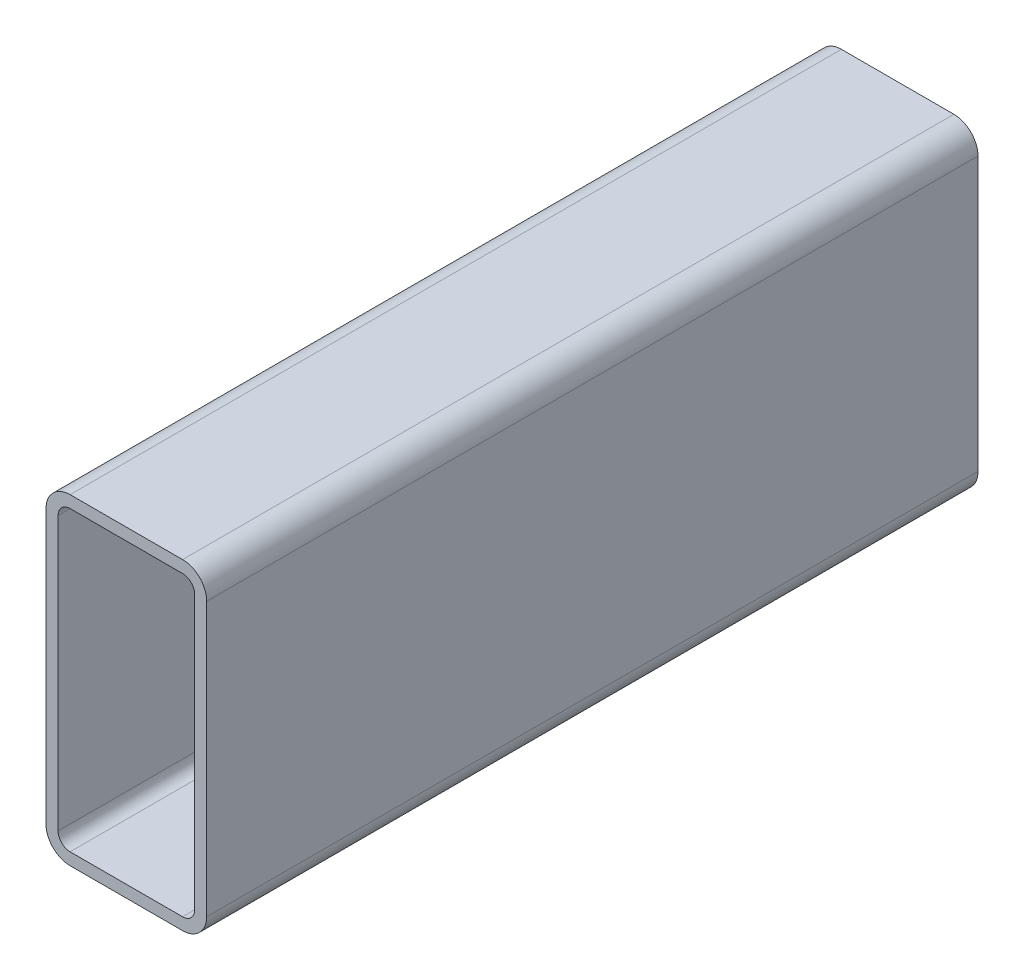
ISO-10303-21;
HEADER;
FILE_DESCRIPTION(('STEP AP214'),'2;1');
FILE_NAME('part.step','',(''),(''),'','','');
FILE_SCHEMA(('AUTOMOTIVE_DESIGN { 1 0 10303 214 1 1 1 1 }'));
ENDSEC;
DATA;
#1=APPLICATION_CONTEXT('core data for automotive mechanical design processes');
#2=APPLICATION_PROTOCOL_DEFINITION('international standard','automotive_design',2000,#1);
#3=PRODUCT_CONTEXT('',#1,'mechanical');
#4=PRODUCT('Part','Part','',(#3));
#5=PRODUCT_RELATED_PRODUCT_CATEGORY('part','',(#4));
#6=PRODUCT_DEFINITION_FORMATION('','',#4);
#7=PRODUCT_DEFINITION_CONTEXT('part definition',#1,'design');
#8=PRODUCT_DEFINITION('design','',#6,#7);
#9=PRODUCT_DEFINITION_SHAPE('','',#8);
#10=(LENGTH_UNIT() NAMED_UNIT(*) SI_UNIT(.MILLI.,.METRE.));
#11=(NAMED_UNIT(*) PLANE_ANGLE_UNIT() SI_UNIT($,.RADIAN.));
#12=(NAMED_UNIT(*) SI_UNIT($,.STERADIAN.) SOLID_ANGLE_UNIT());
#13=UNCERTAINTY_MEASURE_WITH_UNIT(LENGTH_MEASURE(1.E-05),#10,'distance_accuracy_value','');
#14=(GEOMETRIC_REPRESENTATION_CONTEXT(3) GLOBAL_UNCERTAINTY_ASSIGNED_CONTEXT((#13)) GLOBAL_UNIT_ASSIGNED_CONTEXT((#10,
#11,#12)) REPRESENTATION_CONTEXT('',''));
#15=CARTESIAN_POINT('',(0.,0.,0.));
#16=DIRECTION('',(0.,0.,1.));
#17=DIRECTION('',(1.,0.,0.));
#18=AXIS2_PLACEMENT_3D('',#15,#16,#17);
#19=CARTESIAN_POINT('',(12.4210851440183,119.50985662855,304.8));
#20=DIRECTION('',(0.,0.,1.));
#21=DIRECTION('',(1.,0.,0.));
#22=AXIS2_PLACEMENT_3D('',#19,#20,#21);
#23=PLANE('',#22);
#24=CARTESIAN_POINT('',(12.4210851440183,119.50985662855,304.8));
#25=DIRECTION('',(0.,0.,1.));
#26=DIRECTION('',(1.,0.,0.));
#27=AXIS2_PLACEMENT_3D('',#24,#25,#26);
#28=CIRCLE('',#27,9.525);
#29=CARTESIAN_POINT('',(12.4210851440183,129.03485662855,304.8));
#30=VERTEX_POINT('',#29);
#31=CARTESIAN_POINT('',(2.89608514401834,119.50985662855,304.8));
#32=VERTEX_POINT('',#31);
#33=EDGE_CURVE('E211',#30,#32,#28,.T.);
#34=ORIENTED_EDGE('',*,*,#33,.T.);
#35=DIRECTION('',(0.,-1.,0.));
#36=VECTOR('',#35,1.);
#37=CARTESIAN_POINT('',(2.89608514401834,11.55985662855,304.8));
#38=LINE('',#37,#36);
#39=CARTESIAN_POINT('',(2.89608514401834,11.55985662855,304.8));
#40=VERTEX_POINT('',#39);
#41=EDGE_CURVE('E214',#32,#40,#38,.T.);
#42=ORIENTED_EDGE('',*,*,#41,.T.);
#43=CARTESIAN_POINT('',(12.4210851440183,11.55985662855,304.8));
#44=DIRECTION('',(0.,0.,1.));
#45=DIRECTION('',(1.,0.,0.));
#46=AXIS2_PLACEMENT_3D('',#43,#44,#45);
#47=CIRCLE('',#46,9.525);
#48=CARTESIAN_POINT('',(12.4210851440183,2.03485662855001,304.8));
#49=VERTEX_POINT('',#48);
#50=EDGE_CURVE('E217',#40,#49,#47,.T.);
#51=ORIENTED_EDGE('',*,*,#50,.T.);
#52=DIRECTION('',(1.,0.,0.));
#53=VECTOR('',#52,1.);
#54=CARTESIAN_POINT('',(56.8710851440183,2.03485662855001,304.8));
#55=LINE('',#54,#53);
#56=CARTESIAN_POINT('',(56.8710851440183,2.03485662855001,304.8));
#57=VERTEX_POINT('',#56);
#58=EDGE_CURVE('E219',#49,#57,#55,.T.);
#59=ORIENTED_EDGE('',*,*,#58,.T.);
#60=CARTESIAN_POINT('',(56.8710851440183,11.55985662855,304.8));
#61=DIRECTION('',(0.,0.,1.));
#62=DIRECTION('',(1.,0.,0.));
#63=AXIS2_PLACEMENT_3D('',#60,#61,#62);
#64=CIRCLE('',#63,9.525);
#65=CARTESIAN_POINT('',(66.3960851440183,11.55985662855,304.8));
#66=VERTEX_POINT('',#65);
#67=EDGE_CURVE('E221',#57,#66,#64,.T.);
#68=ORIENTED_EDGE('',*,*,#67,.T.);
#69=DIRECTION('',(0.,1.,0.));
#70=VECTOR('',#69,1.);
#71=CARTESIAN_POINT('',(66.3960851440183,119.50985662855,304.8));
#72=LINE('',#71,#70);
#73=CARTESIAN_POINT('',(66.3960851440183,119.50985662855,304.8));
#74=VERTEX_POINT('',#73);
#75=EDGE_CURVE('E223',#66,#74,#72,.T.);
#76=ORIENTED_EDGE('',*,*,#75,.T.);
#77=CARTESIAN_POINT('',(56.8710851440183,119.50985662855,304.8));
#78=DIRECTION('',(0.,0.,1.));
#79=DIRECTION('',(1.,0.,0.));
#80=AXIS2_PLACEMENT_3D('',#77,#78,#79);
#81=CIRCLE('',#80,9.525);
#82=CARTESIAN_POINT('',(56.8710851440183,129.03485662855,304.8));
#83=VERTEX_POINT('',#82);
#84=EDGE_CURVE('E225',#74,#83,#81,.T.);
#85=ORIENTED_EDGE('',*,*,#84,.T.);
#86=DIRECTION('',(-1.,0.,0.));
#87=VECTOR('',#86,1.);
#88=CARTESIAN_POINT('',(12.4210851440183,129.03485662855,304.8));
#89=LINE('',#88,#87);
#90=EDGE_CURVE('E227',#83,#30,#89,.T.);
#91=ORIENTED_EDGE('',*,*,#90,.T.);
#92=EDGE_LOOP('',(#34,#42,#51,#59,#68,#76,#85,#91));
#93=FACE_BOUND('',#92,.T.);
#94=DIRECTION('',(0.,-1.,0.));
#95=VECTOR('',#94,1.);
#96=CARTESIAN_POINT('',(7.65858514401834,11.55985662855,304.8));
#97=LINE('',#96,#95);
#98=CARTESIAN_POINT('',(7.65858514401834,119.50985662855,304.8));
#99=VERTEX_POINT('',#98);
#100=CARTESIAN_POINT('',(7.65858514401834,11.55985662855,304.8));
#101=VERTEX_POINT('',#100);
#102=EDGE_CURVE('E154',#99,#101,#97,.T.);
#103=ORIENTED_EDGE('',*,*,#102,.F.);
#104=CARTESIAN_POINT('',(12.4210851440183,119.50985662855,304.8));
#105=DIRECTION('',(0.,0.,1.));
#106=DIRECTION('',(1.,0.,0.));
#107=AXIS2_PLACEMENT_3D('',#104,#105,#106);
#108=CIRCLE('',#107,4.7625);
#109=CARTESIAN_POINT('',(12.4210851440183,124.27235662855,304.8));
#110=VERTEX_POINT('',#109);
#111=EDGE_CURVE('E146',#110,#99,#108,.T.);
#112=ORIENTED_EDGE('',*,*,#111,.F.);
#113=DIRECTION('',(-1.,0.,0.));
#114=VECTOR('',#113,1.);
#115=CARTESIAN_POINT('',(12.4210851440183,124.27235662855,304.8));
#116=LINE('',#115,#114);
#117=CARTESIAN_POINT('',(56.8710851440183,124.27235662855,304.8));
#118=VERTEX_POINT('',#117);
#119=EDGE_CURVE('E179',#118,#110,#116,.T.);
#120=ORIENTED_EDGE('',*,*,#119,.F.);
#121=CARTESIAN_POINT('',(56.8710851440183,119.50985662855,304.8));
#122=DIRECTION('',(0.,0.,1.));
#123=DIRECTION('',(1.,0.,0.));
#124=AXIS2_PLACEMENT_3D('',#121,#122,#123);
#125=CIRCLE('',#124,4.76250000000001);
#126=CARTESIAN_POINT('',(61.6335851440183,119.50985662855,304.8));
#127=VERTEX_POINT('',#126);
#128=EDGE_CURVE('E177',#127,#118,#125,.T.);
#129=ORIENTED_EDGE('',*,*,#128,.F.);
#130=DIRECTION('',(0.,1.,0.));
#131=VECTOR('',#130,1.);
#132=CARTESIAN_POINT('',(61.6335851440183,119.50985662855,304.8));
#133=LINE('',#132,#131);
#134=CARTESIAN_POINT('',(61.6335851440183,11.55985662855,304.8));
#135=VERTEX_POINT('',#134);
#136=EDGE_CURVE('E175',#135,#127,#133,.T.);
#137=ORIENTED_EDGE('',*,*,#136,.F.);
#138=CARTESIAN_POINT('',(56.8710851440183,11.55985662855,304.8));
#139=DIRECTION('',(0.,0.,1.));
#140=DIRECTION('',(1.,0.,0.));
#141=AXIS2_PLACEMENT_3D('',#138,#139,#140);
#142=CIRCLE('',#141,4.7625);
#143=CARTESIAN_POINT('',(56.8710851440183,6.79735662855,304.8));
#144=VERTEX_POINT('',#143);
#145=EDGE_CURVE('E173',#144,#135,#142,.T.);
#146=ORIENTED_EDGE('',*,*,#145,.F.);
#147=DIRECTION('',(1.,0.,0.));
#148=VECTOR('',#147,1.);
#149=CARTESIAN_POINT('',(56.8710851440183,6.79735662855,304.8));
#150=LINE('',#149,#148);
#151=CARTESIAN_POINT('',(12.4210851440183,6.79735662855,304.8));
#152=VERTEX_POINT('',#151);
#153=EDGE_CURVE('E169',#152,#144,#150,.T.);
#154=ORIENTED_EDGE('',*,*,#153,.F.);
#155=CARTESIAN_POINT('',(12.4210851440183,11.55985662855,304.8));
#156=DIRECTION('',(0.,0.,1.));
#157=DIRECTION('',(1.,0.,0.));
#158=AXIS2_PLACEMENT_3D('',#155,#156,#157);
#159=CIRCLE('',#158,4.7625);
#160=EDGE_CURVE('E167',#101,#152,#159,.T.);
#161=ORIENTED_EDGE('',*,*,#160,.F.);
#162=EDGE_LOOP('',(#103,#112,#120,#129,#137,#146,#154,#161));
#163=FACE_BOUND('',#162,.T.);
#164=ADVANCED_FACE('F33',(#93,#163),#23,.T.);
#165=CARTESIAN_POINT('',(12.4210851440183,119.50985662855,0.));
#166=DIRECTION('',(0.,0.,1.));
#167=DIRECTION('',(1.,0.,0.));
#168=AXIS2_PLACEMENT_3D('',#165,#166,#167);
#169=PLANE('',#168);
#170=CARTESIAN_POINT('',(12.4210851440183,119.50985662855,0.));
#171=DIRECTION('',(0.,0.,1.));
#172=DIRECTION('',(1.,0.,0.));
#173=AXIS2_PLACEMENT_3D('',#170,#171,#172);
#174=CIRCLE('',#173,9.525);
#175=CARTESIAN_POINT('',(12.4210851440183,129.03485662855,0.));
#176=VERTEX_POINT('',#175);
#177=CARTESIAN_POINT('',(2.89608514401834,119.50985662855,0.));
#178=VERTEX_POINT('',#177);
#179=EDGE_CURVE('E162',#176,#178,#174,.T.);
#180=ORIENTED_EDGE('',*,*,#179,.F.);
#181=DIRECTION('',(-1.,0.,0.));
#182=VECTOR('',#181,1.);
#183=CARTESIAN_POINT('',(12.4210851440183,129.03485662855,0.));
#184=LINE('',#183,#182);
#185=CARTESIAN_POINT('',(56.8710851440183,129.03485662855,0.));
#186=VERTEX_POINT('',#185);
#187=EDGE_CURVE('E215',#186,#176,#184,.T.);
#188=ORIENTED_EDGE('',*,*,#187,.F.);
#189=CARTESIAN_POINT('',(56.8710851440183,119.50985662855,0.));
#190=DIRECTION('',(0.,0.,1.));
#191=DIRECTION('',(1.,0.,0.));
#192=AXIS2_PLACEMENT_3D('',#189,#190,#191);
#193=CIRCLE('',#192,9.525);
#194=CARTESIAN_POINT('',(66.3960851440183,119.50985662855,0.));
#195=VERTEX_POINT('',#194);
#196=EDGE_CURVE('E242',#195,#186,#193,.T.);
#197=ORIENTED_EDGE('',*,*,#196,.F.);
#198=DIRECTION('',(0.,1.,0.));
#199=VECTOR('',#198,1.);
#200=CARTESIAN_POINT('',(66.3960851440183,119.50985662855,0.));
#201=LINE('',#200,#199);
#202=CARTESIAN_POINT('',(66.3960851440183,11.55985662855,0.));
#203=VERTEX_POINT('',#202);
#204=EDGE_CURVE('E240',#203,#195,#201,.T.);
#205=ORIENTED_EDGE('',*,*,#204,.F.);
#206=CARTESIAN_POINT('',(56.8710851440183,11.55985662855,0.));
#207=DIRECTION('',(0.,0.,1.));
#208=DIRECTION('',(1.,0.,0.));
#209=AXIS2_PLACEMENT_3D('',#206,#207,#208);
#210=CIRCLE('',#209,9.525);
#211=CARTESIAN_POINT('',(56.8710851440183,2.03485662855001,0.));
#212=VERTEX_POINT('',#211);
#213=EDGE_CURVE('E238',#212,#203,#210,.T.);
#214=ORIENTED_EDGE('',*,*,#213,.F.);
#215=DIRECTION('',(1.,0.,0.));
#216=VECTOR('',#215,1.);
#217=CARTESIAN_POINT('',(56.8710851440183,2.03485662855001,0.));
#218=LINE('',#217,#216);
#219=CARTESIAN_POINT('',(12.4210851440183,2.03485662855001,0.));
#220=VERTEX_POINT('',#219);
#221=EDGE_CURVE('E236',#220,#212,#218,.T.);
#222=ORIENTED_EDGE('',*,*,#221,.F.);
#223=CARTESIAN_POINT('',(12.4210851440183,11.55985662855,0.));
#224=DIRECTION('',(0.,0.,1.));
#225=DIRECTION('',(1.,0.,0.));
#226=AXIS2_PLACEMENT_3D('',#223,#224,#225);
#227=CIRCLE('',#226,9.525);
#228=CARTESIAN_POINT('',(2.89608514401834,11.55985662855,0.));
#229=VERTEX_POINT('',#228);
#230=EDGE_CURVE('E234',#229,#220,#227,.T.);
#231=ORIENTED_EDGE('',*,*,#230,.F.);
#232=DIRECTION('',(0.,-1.,0.));
#233=VECTOR('',#232,1.);
#234=CARTESIAN_POINT('',(2.89608514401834,11.55985662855,0.));
#235=LINE('',#234,#233);
#236=EDGE_CURVE('E232',#178,#229,#235,.T.);
#237=ORIENTED_EDGE('',*,*,#236,.F.);
#238=EDGE_LOOP('',(#180,#188,#197,#205,#214,#222,#231,#237));
#239=FACE_BOUND('',#238,.T.);
#240=CARTESIAN_POINT('',(12.4210851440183,119.50985662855,0.));
#241=DIRECTION('',(0.,0.,1.));
#242=DIRECTION('',(1.,0.,0.));
#243=AXIS2_PLACEMENT_3D('',#240,#241,#242);
#244=CIRCLE('',#243,4.7625);
#245=CARTESIAN_POINT('',(12.4210851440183,124.27235662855,0.));
#246=VERTEX_POINT('',#245);
#247=CARTESIAN_POINT('',(7.65858514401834,119.50985662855,0.));
#248=VERTEX_POINT('',#247);
#249=EDGE_CURVE('E56',#246,#248,#244,.T.);
#250=ORIENTED_EDGE('',*,*,#249,.T.);
#251=DIRECTION('',(0.,-1.,0.));
#252=VECTOR('',#251,1.);
#253=CARTESIAN_POINT('',(7.65858514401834,11.55985662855,0.));
#254=LINE('',#253,#252);
#255=CARTESIAN_POINT('',(7.65858514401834,11.55985662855,0.));
#256=VERTEX_POINT('',#255);
#257=EDGE_CURVE('E161',#248,#256,#254,.T.);
#258=ORIENTED_EDGE('',*,*,#257,.T.);
#259=CARTESIAN_POINT('',(12.4210851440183,11.55985662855,0.));
#260=DIRECTION('',(0.,0.,1.));
#261=DIRECTION('',(1.,0.,0.));
#262=AXIS2_PLACEMENT_3D('',#259,#260,#261);
#263=CIRCLE('',#262,4.7625);
#264=CARTESIAN_POINT('',(12.4210851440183,6.79735662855,0.));
#265=VERTEX_POINT('',#264);
#266=EDGE_CURVE('E183',#256,#265,#263,.T.);
#267=ORIENTED_EDGE('',*,*,#266,.T.);
#268=DIRECTION('',(1.,0.,0.));
#269=VECTOR('',#268,1.);
#270=CARTESIAN_POINT('',(56.8710851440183,6.79735662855,0.));
#271=LINE('',#270,#269);
#272=CARTESIAN_POINT('',(56.8710851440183,6.79735662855,0.));
#273=VERTEX_POINT('',#272);
#274=EDGE_CURVE('E186',#265,#273,#271,.T.);
#275=ORIENTED_EDGE('',*,*,#274,.T.);
#276=CARTESIAN_POINT('',(56.8710851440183,11.55985662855,0.));
#277=DIRECTION('',(0.,0.,1.));
#278=DIRECTION('',(1.,0.,0.));
#279=AXIS2_PLACEMENT_3D('',#276,#277,#278);
#280=CIRCLE('',#279,4.7625);
#281=CARTESIAN_POINT('',(61.6335851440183,11.55985662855,0.));
#282=VERTEX_POINT('',#281);
#283=EDGE_CURVE('E189',#273,#282,#280,.T.);
#284=ORIENTED_EDGE('',*,*,#283,.T.);
#285=DIRECTION('',(0.,1.,0.));
#286=VECTOR('',#285,1.);
#287=CARTESIAN_POINT('',(61.6335851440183,119.50985662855,0.));
#288=LINE('',#287,#286);
#289=CARTESIAN_POINT('',(61.6335851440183,119.50985662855,0.));
#290=VERTEX_POINT('',#289);
#291=EDGE_CURVE('E192',#282,#290,#288,.T.);
#292=ORIENTED_EDGE('',*,*,#291,.T.);
#293=CARTESIAN_POINT('',(56.8710851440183,119.50985662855,0.));
#294=DIRECTION('',(0.,0.,1.));
#295=DIRECTION('',(1.,0.,0.));
#296=AXIS2_PLACEMENT_3D('',#293,#294,#295);
#297=CIRCLE('',#296,4.76250000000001);
#298=CARTESIAN_POINT('',(56.8710851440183,124.27235662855,0.));
#299=VERTEX_POINT('',#298);
#300=EDGE_CURVE('E195',#290,#299,#297,.T.);
#301=ORIENTED_EDGE('',*,*,#300,.T.);
#302=DIRECTION('',(-1.,0.,0.));
#303=VECTOR('',#302,1.);
#304=CARTESIAN_POINT('',(12.4210851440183,124.27235662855,0.));
#305=LINE('',#304,#303);
#306=EDGE_CURVE('E155',#299,#246,#305,.T.);
#307=ORIENTED_EDGE('',*,*,#306,.T.);
#308=EDGE_LOOP('',(#250,#258,#267,#275,#284,#292,#301,#307));
#309=FACE_BOUND('',#308,.T.);
#310=ADVANCED_FACE('F272',(#239,#309),#169,.F.);
#311=CARTESIAN_POINT('',(12.4210851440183,119.50985662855,304.8));
#312=DIRECTION('',(0.,0.,-1.));
#313=DIRECTION('',(-1.,0.,0.));
#314=AXIS2_PLACEMENT_3D('',#311,#312,#313);
#315=CYLINDRICAL_SURFACE('',#314,9.525);
#316=ORIENTED_EDGE('',*,*,#179,.T.);
#317=DIRECTION('',(0.,0.,-1.));
#318=VECTOR('',#317,1.);
#319=CARTESIAN_POINT('',(2.89608514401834,119.50985662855,304.8));
#320=LINE('',#319,#318);
#321=EDGE_CURVE('E11',#32,#178,#320,.T.);
#322=ORIENTED_EDGE('',*,*,#321,.F.);
#323=ORIENTED_EDGE('',*,*,#33,.F.);
#324=DIRECTION('',(0.,0.,-1.));
#325=VECTOR('',#324,1.);
#326=CARTESIAN_POINT('',(12.4210851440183,129.03485662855,304.8));
#327=LINE('',#326,#325);
#328=EDGE_CURVE('E229',#30,#176,#327,.T.);
#329=ORIENTED_EDGE('',*,*,#328,.T.);
#330=EDGE_LOOP('',(#316,#322,#323,#329));
#331=FACE_BOUND('',#330,.T.);
#332=ADVANCED_FACE('F35',(#331),#315,.T.);
#333=CARTESIAN_POINT('',(2.89608514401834,11.55985662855,304.8));
#334=DIRECTION('',(1.,0.,0.));
#335=DIRECTION('',(0.,0.,-1.));
#336=AXIS2_PLACEMENT_3D('',#333,#334,#335);
#337=PLANE('',#336);
#338=ORIENTED_EDGE('',*,*,#236,.T.);
#339=DIRECTION('',(0.,0.,-1.));
#340=VECTOR('',#339,1.);
#341=CARTESIAN_POINT('',(2.89608514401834,11.55985662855,304.8));
#342=LINE('',#341,#340);
#343=EDGE_CURVE('E41',#40,#229,#342,.T.);
#344=ORIENTED_EDGE('',*,*,#343,.F.);
#345=ORIENTED_EDGE('',*,*,#41,.F.);
#346=ORIENTED_EDGE('',*,*,#321,.T.);
#347=EDGE_LOOP('',(#338,#344,#345,#346));
#348=FACE_BOUND('',#347,.T.);
#349=ADVANCED_FACE('F289',(#348),#337,.F.);
#350=CARTESIAN_POINT('',(12.4210851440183,11.55985662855,304.8));
#351=DIRECTION('',(0.,0.,-1.));
#352=DIRECTION('',(-1.,0.,0.));
#353=AXIS2_PLACEMENT_3D('',#350,#351,#352);
#354=CYLINDRICAL_SURFACE('',#353,9.525);
#355=ORIENTED_EDGE('',*,*,#230,.T.);
#356=DIRECTION('',(0.,0.,-1.));
#357=VECTOR('',#356,1.);
#358=CARTESIAN_POINT('',(12.4210851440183,2.03485662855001,304.8));
#359=LINE('',#358,#357);
#360=EDGE_CURVE('E259',#49,#220,#359,.T.);
#361=ORIENTED_EDGE('',*,*,#360,.F.);
#362=ORIENTED_EDGE('',*,*,#50,.F.);
#363=ORIENTED_EDGE('',*,*,#343,.T.);
#364=EDGE_LOOP('',(#355,#361,#362,#363));
#365=FACE_BOUND('',#364,.T.);
#366=ADVANCED_FACE('F266',(#365),#354,.T.);
#367=CARTESIAN_POINT('',(56.8710851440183,2.03485662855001,304.8));
#368=DIRECTION('',(0.,1.,0.));
#369=DIRECTION('',(0.,0.,1.));
#370=AXIS2_PLACEMENT_3D('',#367,#368,#369);
#371=PLANE('',#370);
#372=ORIENTED_EDGE('',*,*,#221,.T.);
#373=DIRECTION('',(0.,0.,-1.));
#374=VECTOR('',#373,1.);
#375=CARTESIAN_POINT('',(56.8710851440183,2.03485662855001,304.8));
#376=LINE('',#375,#374);
#377=EDGE_CURVE('E256',#57,#212,#376,.T.);
#378=ORIENTED_EDGE('',*,*,#377,.F.);
#379=ORIENTED_EDGE('',*,*,#58,.F.);
#380=ORIENTED_EDGE('',*,*,#360,.T.);
#381=EDGE_LOOP('',(#372,#378,#379,#380));
#382=FACE_BOUND('',#381,.T.);
#383=ADVANCED_FACE('F278',(#382),#371,.F.);
#384=CARTESIAN_POINT('',(56.8710851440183,11.55985662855,304.8));
#385=DIRECTION('',(0.,0.,-1.));
#386=DIRECTION('',(-1.,0.,0.));
#387=AXIS2_PLACEMENT_3D('',#384,#385,#386);
#388=CYLINDRICAL_SURFACE('',#387,9.525);
#389=ORIENTED_EDGE('',*,*,#213,.T.);
#390=DIRECTION('',(0.,0.,-1.));
#391=VECTOR('',#390,1.);
#392=CARTESIAN_POINT('',(66.3960851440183,11.55985662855,304.8));
#393=LINE('',#392,#391);
#394=EDGE_CURVE('E253',#66,#203,#393,.T.);
#395=ORIENTED_EDGE('',*,*,#394,.F.);
#396=ORIENTED_EDGE('',*,*,#67,.F.);
#397=ORIENTED_EDGE('',*,*,#377,.T.);
#398=EDGE_LOOP('',(#389,#395,#396,#397));
#399=FACE_BOUND('',#398,.T.);
#400=ADVANCED_FACE('F282',(#399),#388,.T.);
#401=CARTESIAN_POINT('',(66.3960851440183,119.50985662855,304.8));
#402=DIRECTION('',(-1.,0.,0.));
#403=DIRECTION('',(0.,0.,1.));
#404=AXIS2_PLACEMENT_3D('',#401,#402,#403);
#405=PLANE('',#404);
#406=ORIENTED_EDGE('',*,*,#204,.T.);
#407=DIRECTION('',(0.,0.,-1.));
#408=VECTOR('',#407,1.);
#409=CARTESIAN_POINT('',(66.3960851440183,119.50985662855,304.8));
#410=LINE('',#409,#408);
#411=EDGE_CURVE('E250',#74,#195,#410,.T.);
#412=ORIENTED_EDGE('',*,*,#411,.F.);
#413=ORIENTED_EDGE('',*,*,#75,.F.);
#414=ORIENTED_EDGE('',*,*,#394,.T.);
#415=EDGE_LOOP('',(#406,#412,#413,#414));
#416=FACE_BOUND('',#415,.T.);
#417=ADVANCED_FACE('F302',(#416),#405,.F.);
#418=CARTESIAN_POINT('',(56.8710851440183,119.50985662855,304.8));
#419=DIRECTION('',(0.,0.,-1.));
#420=DIRECTION('',(-1.,0.,0.));
#421=AXIS2_PLACEMENT_3D('',#418,#419,#420);
#422=CYLINDRICAL_SURFACE('',#421,9.525);
#423=ORIENTED_EDGE('',*,*,#196,.T.);
#424=DIRECTION('',(0.,0.,-1.));
#425=VECTOR('',#424,1.);
#426=CARTESIAN_POINT('',(56.8710851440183,129.03485662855,304.8));
#427=LINE('',#426,#425);
#428=EDGE_CURVE('E247',#83,#186,#427,.T.);
#429=ORIENTED_EDGE('',*,*,#428,.F.);
#430=ORIENTED_EDGE('',*,*,#84,.F.);
#431=ORIENTED_EDGE('',*,*,#411,.T.);
#432=EDGE_LOOP('',(#423,#429,#430,#431));
#433=FACE_BOUND('',#432,.T.);
#434=ADVANCED_FACE('F300',(#433),#422,.T.);
#435=CARTESIAN_POINT('',(12.4210851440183,129.03485662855,304.8));
#436=DIRECTION('',(0.,-1.,0.));
#437=DIRECTION('',(0.,0.,-1.));
#438=AXIS2_PLACEMENT_3D('',#435,#436,#437);
#439=PLANE('',#438);
#440=ORIENTED_EDGE('',*,*,#187,.T.);
#441=ORIENTED_EDGE('',*,*,#328,.F.);
#442=ORIENTED_EDGE('',*,*,#90,.F.);
#443=ORIENTED_EDGE('',*,*,#428,.T.);
#444=EDGE_LOOP('',(#440,#441,#442,#443));
#445=FACE_BOUND('',#444,.T.);
#446=ADVANCED_FACE('F295',(#445),#439,.F.);
#447=CARTESIAN_POINT('',(12.4210851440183,119.50985662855,304.8));
#448=DIRECTION('',(0.,0.,-1.));
#449=DIRECTION('',(-1.,0.,0.));
#450=AXIS2_PLACEMENT_3D('',#447,#448,#449);
#451=CYLINDRICAL_SURFACE('',#450,4.7625);
#452=ORIENTED_EDGE('',*,*,#249,.F.);
#453=DIRECTION('',(0.,0.,-1.));
#454=VECTOR('',#453,1.);
#455=CARTESIAN_POINT('',(12.4210851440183,124.27235662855,304.8));
#456=LINE('',#455,#454);
#457=EDGE_CURVE('E150',#110,#246,#456,.T.);
#458=ORIENTED_EDGE('',*,*,#457,.F.);
#459=ORIENTED_EDGE('',*,*,#111,.T.);
#460=DIRECTION('',(0.,0.,-1.));
#461=VECTOR('',#460,1.);
#462=CARTESIAN_POINT('',(7.65858514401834,119.50985662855,304.8));
#463=LINE('',#462,#461);
#464=EDGE_CURVE('E149',#99,#248,#463,.T.);
#465=ORIENTED_EDGE('',*,*,#464,.T.);
#466=EDGE_LOOP('',(#452,#458,#459,#465));
#467=FACE_BOUND('',#466,.T.);
#468=ADVANCED_FACE('F148',(#467),#451,.F.);
#469=CARTESIAN_POINT('',(7.65858514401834,11.55985662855,304.8));
#470=DIRECTION('',(1.,0.,0.));
#471=DIRECTION('',(0.,0.,-1.));
#472=AXIS2_PLACEMENT_3D('',#469,#470,#471);
#473=PLANE('',#472);
#474=ORIENTED_EDGE('',*,*,#257,.F.);
#475=ORIENTED_EDGE('',*,*,#464,.F.);
#476=ORIENTED_EDGE('',*,*,#102,.T.);
#477=DIRECTION('',(0.,0.,-1.));
#478=VECTOR('',#477,1.);
#479=CARTESIAN_POINT('',(7.65858514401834,11.55985662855,304.8));
#480=LINE('',#479,#478);
#481=EDGE_CURVE('E163',#101,#256,#480,.T.);
#482=ORIENTED_EDGE('',*,*,#481,.T.);
#483=EDGE_LOOP('',(#474,#475,#476,#482));
#484=FACE_BOUND('',#483,.T.);
#485=ADVANCED_FACE('F158',(#484),#473,.T.);
#486=CARTESIAN_POINT('',(12.4210851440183,11.55985662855,304.8));
#487=DIRECTION('',(0.,0.,-1.));
#488=DIRECTION('',(-1.,0.,0.));
#489=AXIS2_PLACEMENT_3D('',#486,#487,#488);
#490=CYLINDRICAL_SURFACE('',#489,4.7625);
#491=ORIENTED_EDGE('',*,*,#266,.F.);
#492=ORIENTED_EDGE('',*,*,#481,.F.);
#493=ORIENTED_EDGE('',*,*,#160,.T.);
#494=DIRECTION('',(0.,0.,-1.));
#495=VECTOR('',#494,1.);
#496=CARTESIAN_POINT('',(12.4210851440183,6.79735662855,304.8));
#497=LINE('',#496,#495);
#498=EDGE_CURVE('E208',#152,#265,#497,.T.);
#499=ORIENTED_EDGE('',*,*,#498,.T.);
#500=EDGE_LOOP('',(#491,#492,#493,#499));
#501=FACE_BOUND('',#500,.T.);
#502=ADVANCED_FACE('F327',(#501),#490,.F.);
#503=CARTESIAN_POINT('',(56.8710851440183,6.79735662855,304.8));
#504=DIRECTION('',(0.,1.,0.));
#505=DIRECTION('',(0.,0.,1.));
#506=AXIS2_PLACEMENT_3D('',#503,#504,#505);
#507=PLANE('',#506);
#508=ORIENTED_EDGE('',*,*,#274,.F.);
#509=ORIENTED_EDGE('',*,*,#498,.F.);
#510=ORIENTED_EDGE('',*,*,#153,.T.);
#511=DIRECTION('',(0.,0.,-1.));
#512=VECTOR('',#511,1.);
#513=CARTESIAN_POINT('',(56.8710851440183,6.79735662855,304.8));
#514=LINE('',#513,#512);
#515=EDGE_CURVE('E206',#144,#273,#514,.T.);
#516=ORIENTED_EDGE('',*,*,#515,.T.);
#517=EDGE_LOOP('',(#508,#509,#510,#516));
#518=FACE_BOUND('',#517,.T.);
#519=ADVANCED_FACE('F331',(#518),#507,.T.);
#520=CARTESIAN_POINT('',(56.8710851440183,11.55985662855,304.8));
#521=DIRECTION('',(0.,0.,-1.));
#522=DIRECTION('',(-1.,0.,0.));
#523=AXIS2_PLACEMENT_3D('',#520,#521,#522);
#524=CYLINDRICAL_SURFACE('',#523,4.7625);
#525=ORIENTED_EDGE('',*,*,#283,.F.);
#526=ORIENTED_EDGE('',*,*,#515,.F.);
#527=ORIENTED_EDGE('',*,*,#145,.T.);
#528=DIRECTION('',(0.,0.,-1.));
#529=VECTOR('',#528,1.);
#530=CARTESIAN_POINT('',(61.6335851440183,11.55985662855,304.8));
#531=LINE('',#530,#529);
#532=EDGE_CURVE('E204',#135,#282,#531,.T.);
#533=ORIENTED_EDGE('',*,*,#532,.T.);
#534=EDGE_LOOP('',(#525,#526,#527,#533));
#535=FACE_BOUND('',#534,.T.);
#536=ADVANCED_FACE('F337',(#535),#524,.F.);
#537=CARTESIAN_POINT('',(61.6335851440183,119.50985662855,304.8));
#538=DIRECTION('',(-1.,0.,0.));
#539=DIRECTION('',(0.,0.,1.));
#540=AXIS2_PLACEMENT_3D('',#537,#538,#539);
#541=PLANE('',#540);
#542=ORIENTED_EDGE('',*,*,#291,.F.);
#543=ORIENTED_EDGE('',*,*,#532,.F.);
#544=ORIENTED_EDGE('',*,*,#136,.T.);
#545=DIRECTION('',(0.,0.,-1.));
#546=VECTOR('',#545,1.);
#547=CARTESIAN_POINT('',(61.6335851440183,119.50985662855,304.8));
#548=LINE('',#547,#546);
#549=EDGE_CURVE('E202',#127,#290,#548,.T.);
#550=ORIENTED_EDGE('',*,*,#549,.T.);
#551=EDGE_LOOP('',(#542,#543,#544,#550));
#552=FACE_BOUND('',#551,.T.);
#553=ADVANCED_FACE('F341',(#552),#541,.T.);
#554=CARTESIAN_POINT('',(56.8710851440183,119.50985662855,304.8));
#555=DIRECTION('',(0.,0.,-1.));
#556=DIRECTION('',(-1.,0.,0.));
#557=AXIS2_PLACEMENT_3D('',#554,#555,#556);
#558=CYLINDRICAL_SURFACE('',#557,4.76250000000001);
#559=ORIENTED_EDGE('',*,*,#300,.F.);
#560=ORIENTED_EDGE('',*,*,#549,.F.);
#561=ORIENTED_EDGE('',*,*,#128,.T.);
#562=DIRECTION('',(0.,0.,-1.));
#563=VECTOR('',#562,1.);
#564=CARTESIAN_POINT('',(56.8710851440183,124.27235662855,304.8));
#565=LINE('',#564,#563);
#566=EDGE_CURVE('E48',#118,#299,#565,.T.);
#567=ORIENTED_EDGE('',*,*,#566,.T.);
#568=EDGE_LOOP('',(#559,#560,#561,#567));
#569=FACE_BOUND('',#568,.T.);
#570=ADVANCED_FACE('F345',(#569),#558,.F.);
#571=CARTESIAN_POINT('',(12.4210851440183,124.27235662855,304.8));
#572=DIRECTION('',(0.,-1.,0.));
#573=DIRECTION('',(0.,0.,-1.));
#574=AXIS2_PLACEMENT_3D('',#571,#572,#573);
#575=PLANE('',#574);
#576=ORIENTED_EDGE('',*,*,#306,.F.);
#577=ORIENTED_EDGE('',*,*,#566,.F.);
#578=ORIENTED_EDGE('',*,*,#119,.T.);
#579=ORIENTED_EDGE('',*,*,#457,.T.);
#580=EDGE_LOOP('',(#576,#577,#578,#579));
#581=FACE_BOUND('',#580,.T.);
#582=ADVANCED_FACE('F349',(#581),#575,.T.);
#583=CLOSED_SHELL('',(#164,#310,#332,#349,#366,#383,#400,#417,#434,#446,#468,#485,#502,#519,
#536,#553,#570,#582));
#584=MANIFOLD_SOLID_BREP('B2',#583);
#585=ADVANCED_BREP_SHAPE_REPRESENTATION('',(#18,#584),#14);
#586=SHAPE_DEFINITION_REPRESENTATION(#9,#585);
ENDSEC;
END-ISO-10303-21;
